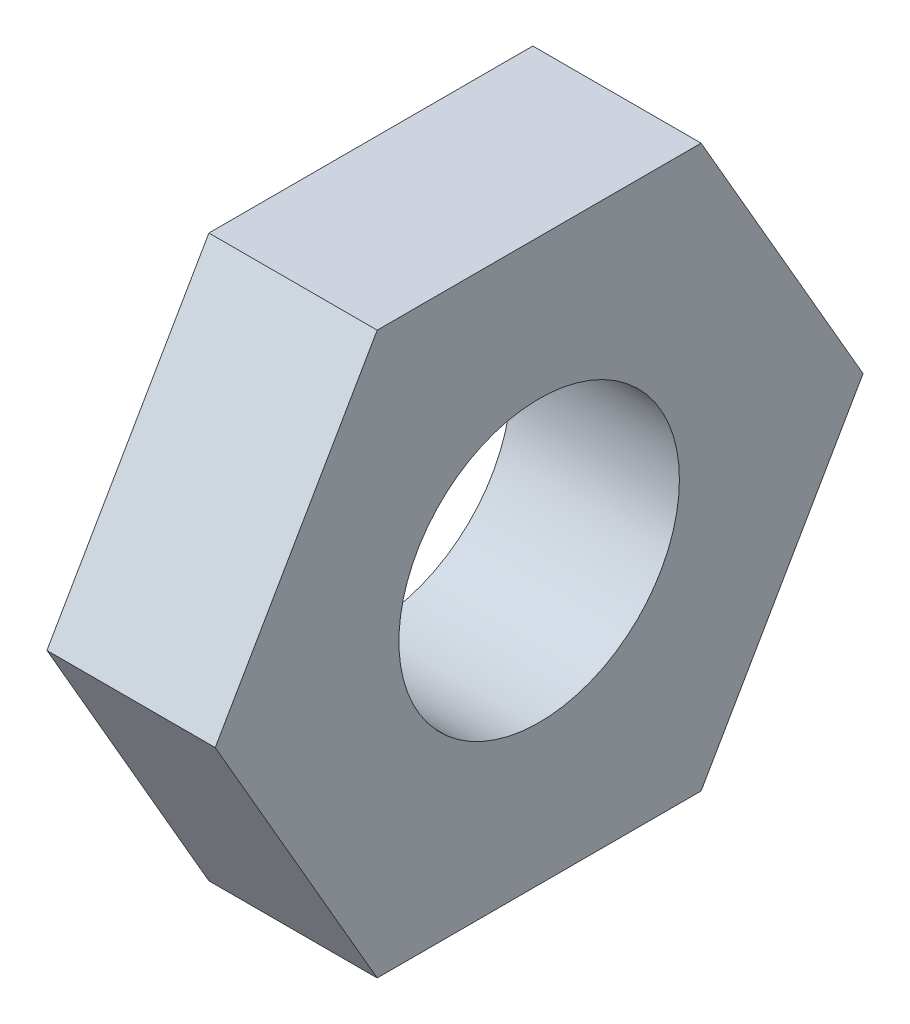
from build123d import *

# Parameters (mm, degrees)
SKETCH1_R           = 2.5
BOSS_EXTRUDE1_DEPTH = 3


with BuildPart() as part:
    # Sketch1 → Boss-Extrude1 (new body)
    with BuildSketch(Plane(origin=(0, 0, 0), x_dir=(0, 0, -1), z_dir=(1, 0, 0))):
        Polygon((5.773502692, 0), (2.886751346, 5), (-2.886751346, 5), (-5.773502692, 0), (-2.886751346, -5), (2.886751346, -5), align=None)
        Circle(SKETCH1_R, mode=Mode.SUBTRACT)
    extrude(amount=BOSS_EXTRUDE1_DEPTH)


solid = part.part
